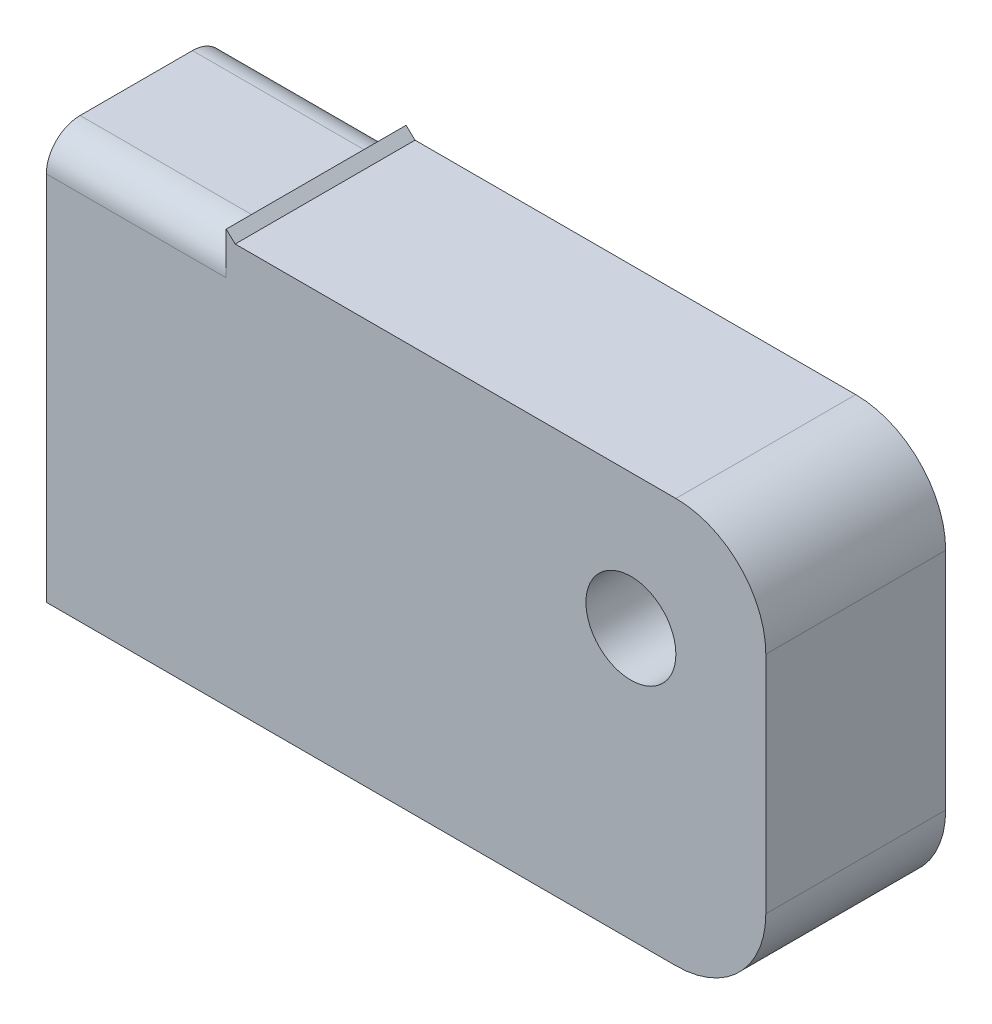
ISO-10303-21;
HEADER;
FILE_DESCRIPTION(('STEP AP214'),'2;1');
FILE_NAME('part.step','',(''),(''),'','','');
FILE_SCHEMA(('AUTOMOTIVE_DESIGN { 1 0 10303 214 1 1 1 1 }'));
ENDSEC;
DATA;
#1=APPLICATION_CONTEXT('core data for automotive mechanical design processes');
#2=APPLICATION_PROTOCOL_DEFINITION('international standard','automotive_design',2000,#1);
#3=PRODUCT_CONTEXT('',#1,'mechanical');
#4=PRODUCT('Part','Part','',(#3));
#5=PRODUCT_RELATED_PRODUCT_CATEGORY('part','',(#4));
#6=PRODUCT_DEFINITION_FORMATION('','',#4);
#7=PRODUCT_DEFINITION_CONTEXT('part definition',#1,'design');
#8=PRODUCT_DEFINITION('design','',#6,#7);
#9=PRODUCT_DEFINITION_SHAPE('','',#8);
#10=(LENGTH_UNIT() NAMED_UNIT(*) SI_UNIT(.MILLI.,.METRE.));
#11=(NAMED_UNIT(*) PLANE_ANGLE_UNIT() SI_UNIT($,.RADIAN.));
#12=(NAMED_UNIT(*) SI_UNIT($,.STERADIAN.) SOLID_ANGLE_UNIT());
#13=UNCERTAINTY_MEASURE_WITH_UNIT(LENGTH_MEASURE(1.E-05),#10,'distance_accuracy_value','');
#14=(GEOMETRIC_REPRESENTATION_CONTEXT(3) GLOBAL_UNCERTAINTY_ASSIGNED_CONTEXT((#13)) GLOBAL_UNIT_ASSIGNED_CONTEXT((#10,
#11,#12)) REPRESENTATION_CONTEXT('',''));
#15=CARTESIAN_POINT('',(0.,0.,0.));
#16=DIRECTION('',(0.,0.,1.));
#17=DIRECTION('',(1.,0.,0.));
#18=AXIS2_PLACEMENT_3D('',#15,#16,#17);
#19=CARTESIAN_POINT('',(0.,0.,50.8));
#20=DIRECTION('',(0.,-1.,0.));
#21=DIRECTION('',(1.,0.,0.));
#22=AXIS2_PLACEMENT_3D('',#19,#20,#21);
#23=PLANE('',#22);
#24=DIRECTION('',(0.,0.,-1.));
#25=VECTOR('',#24,1.);
#26=CARTESIAN_POINT('',(-203.2,0.,50.8));
#27=LINE('',#26,#25);
#28=CARTESIAN_POINT('',(-203.2,0.,41.275));
#29=VERTEX_POINT('',#28);
#30=CARTESIAN_POINT('',(-203.2,0.,9.525));
#31=VERTEX_POINT('',#30);
#32=EDGE_CURVE('E175',#29,#31,#27,.T.);
#33=ORIENTED_EDGE('',*,*,#32,.F.);
#34=DIRECTION('',(-1.,0.,0.));
#35=VECTOR('',#34,1.);
#36=CARTESIAN_POINT('',(0.,0.,41.275));
#37=LINE('',#36,#35);
#38=CARTESIAN_POINT('',(-152.4,0.,41.275));
#39=VERTEX_POINT('',#38);
#40=EDGE_CURVE('E55',#29,#39,#37,.F.);
#41=ORIENTED_EDGE('',*,*,#40,.T.);
#42=DIRECTION('',(0.,0.,1.));
#43=VECTOR('',#42,1.);
#44=CARTESIAN_POINT('',(-152.4,0.,0.));
#45=LINE('',#44,#43);
#46=CARTESIAN_POINT('',(-152.4,0.,9.525));
#47=VERTEX_POINT('',#46);
#48=EDGE_CURVE('E123',#47,#39,#45,.T.);
#49=ORIENTED_EDGE('',*,*,#48,.F.);
#50=DIRECTION('',(-1.,0.,0.));
#51=VECTOR('',#50,1.);
#52=CARTESIAN_POINT('',(-203.2,0.,9.525));
#53=LINE('',#52,#51);
#54=EDGE_CURVE('E203',#47,#31,#53,.T.);
#55=ORIENTED_EDGE('',*,*,#54,.T.);
#56=EDGE_LOOP('',(#33,#41,#49,#55));
#57=FACE_BOUND('',#56,.T.);
#58=ADVANCED_FACE('F33',(#57),#23,.F.);
#59=CARTESIAN_POINT('',(0.,-114.3,50.8));
#60=DIRECTION('',(-1.,0.,0.));
#61=DIRECTION('',(0.,0.,1.));
#62=AXIS2_PLACEMENT_3D('',#59,#60,#61);
#63=PLANE('',#62);
#64=DIRECTION('',(0.,1.,0.));
#65=VECTOR('',#64,1.);
#66=CARTESIAN_POINT('',(0.,-114.3,50.8));
#67=LINE('',#66,#65);
#68=CARTESIAN_POINT('',(0.,-88.9,50.8));
#69=VERTEX_POINT('',#68);
#70=CARTESIAN_POINT('',(0.,-25.4,50.8));
#71=VERTEX_POINT('',#70);
#72=EDGE_CURVE('E152',#69,#71,#67,.T.);
#73=ORIENTED_EDGE('',*,*,#72,.F.);
#74=DIRECTION('',(0.,0.,-1.));
#75=VECTOR('',#74,1.);
#76=CARTESIAN_POINT('',(0.,-88.9,50.8));
#77=LINE('',#76,#75);
#78=CARTESIAN_POINT('',(0.,-88.9,0.));
#79=VERTEX_POINT('',#78);
#80=EDGE_CURVE('E180',#69,#79,#77,.T.);
#81=ORIENTED_EDGE('',*,*,#80,.T.);
#82=DIRECTION('',(0.,1.,0.));
#83=VECTOR('',#82,1.);
#84=CARTESIAN_POINT('',(0.,-114.3,0.));
#85=LINE('',#84,#83);
#86=CARTESIAN_POINT('',(0.,-25.4,0.));
#87=VERTEX_POINT('',#86);
#88=EDGE_CURVE('E149',#79,#87,#85,.T.);
#89=ORIENTED_EDGE('',*,*,#88,.T.);
#90=DIRECTION('',(0.,0.,-1.));
#91=VECTOR('',#90,1.);
#92=CARTESIAN_POINT('',(0.,-25.4,50.8));
#93=LINE('',#92,#91);
#94=EDGE_CURVE('E178',#87,#71,#93,.F.);
#95=ORIENTED_EDGE('',*,*,#94,.T.);
#96=EDGE_LOOP('',(#73,#81,#89,#95));
#97=FACE_BOUND('',#96,.T.);
#98=ADVANCED_FACE('F229',(#97),#63,.F.);
#99=DIRECTION('',(-1.,0.,0.));
#100=VECTOR('',#99,1.);
#101=CARTESIAN_POINT('',(0.,0.,0.));
#102=LINE('',#101,#100);
#103=CARTESIAN_POINT('',(-25.4,0.,0.));
#104=VERTEX_POINT('',#103);
#105=CARTESIAN_POINT('',(-149.86,0.,0.));
#106=VERTEX_POINT('',#105);
#107=EDGE_CURVE('E167',#104,#106,#102,.T.);
#108=ORIENTED_EDGE('',*,*,#107,.T.);
#109=DIRECTION('',(0.,0.,1.));
#110=VECTOR('',#109,1.);
#111=CARTESIAN_POINT('',(-149.86,0.,0.));
#112=LINE('',#111,#110);
#113=CARTESIAN_POINT('',(-149.86,0.,50.8));
#114=VERTEX_POINT('',#113);
#115=EDGE_CURVE('E124',#106,#114,#112,.T.);
#116=ORIENTED_EDGE('',*,*,#115,.T.);
#117=DIRECTION('',(-1.,0.,0.));
#118=VECTOR('',#117,1.);
#119=CARTESIAN_POINT('',(0.,0.,50.8));
#120=LINE('',#119,#118);
#121=CARTESIAN_POINT('',(-25.4,0.,50.8));
#122=VERTEX_POINT('',#121);
#123=EDGE_CURVE('E155',#122,#114,#120,.T.);
#124=ORIENTED_EDGE('',*,*,#123,.F.);
#125=DIRECTION('',(0.,0.,-1.));
#126=VECTOR('',#125,1.);
#127=CARTESIAN_POINT('',(-25.4,0.,50.8));
#128=LINE('',#127,#126);
#129=EDGE_CURVE('E193',#122,#104,#128,.T.);
#130=ORIENTED_EDGE('',*,*,#129,.T.);
#131=EDGE_LOOP('',(#108,#116,#124,#130));
#132=FACE_BOUND('',#131,.T.);
#133=ADVANCED_FACE('F237',(#132),#23,.F.);
#134=CARTESIAN_POINT('',(-203.2,0.,50.8));
#135=DIRECTION('',(1.,0.,0.));
#136=DIRECTION('',(0.,1.,0.));
#137=AXIS2_PLACEMENT_3D('',#134,#135,#136);
#138=PLANE('',#137);
#139=DIRECTION('',(0.,-1.,0.));
#140=VECTOR('',#139,1.);
#141=CARTESIAN_POINT('',(-203.2,0.,50.8));
#142=LINE('',#141,#140);
#143=CARTESIAN_POINT('',(-203.2,-9.52500000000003,50.8));
#144=VERTEX_POINT('',#143);
#145=CARTESIAN_POINT('',(-203.2,-114.3,50.8));
#146=VERTEX_POINT('',#145);
#147=EDGE_CURVE('E159',#144,#146,#142,.T.);
#148=ORIENTED_EDGE('',*,*,#147,.F.);
#149=CARTESIAN_POINT('',(-203.2,-9.52500000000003,41.275));
#150=DIRECTION('',(1.,0.,0.));
#151=DIRECTION('',(0.,1.,0.));
#152=AXIS2_PLACEMENT_3D('',#149,#150,#151);
#153=CIRCLE('',#152,9.525);
#154=EDGE_CURVE('E201',#144,#29,#153,.F.);
#155=ORIENTED_EDGE('',*,*,#154,.T.);
#156=ORIENTED_EDGE('',*,*,#32,.T.);
#157=CARTESIAN_POINT('',(-203.2,-9.52500000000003,9.525));
#158=DIRECTION('',(1.,0.,0.));
#159=DIRECTION('',(0.,1.,0.));
#160=AXIS2_PLACEMENT_3D('',#157,#158,#159);
#161=CIRCLE('',#160,9.525);
#162=CARTESIAN_POINT('',(-203.2,-9.52500000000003,0.));
#163=VERTEX_POINT('',#162);
#164=EDGE_CURVE('E199',#31,#163,#161,.F.);
#165=ORIENTED_EDGE('',*,*,#164,.T.);
#166=DIRECTION('',(0.,-1.,0.));
#167=VECTOR('',#166,1.);
#168=CARTESIAN_POINT('',(-203.2,0.,0.));
#169=LINE('',#168,#167);
#170=CARTESIAN_POINT('',(-203.2,-114.3,0.));
#171=VERTEX_POINT('',#170);
#172=EDGE_CURVE('E169',#163,#171,#169,.T.);
#173=ORIENTED_EDGE('',*,*,#172,.T.);
#174=DIRECTION('',(0.,0.,-1.));
#175=VECTOR('',#174,1.);
#176=CARTESIAN_POINT('',(-203.2,-114.3,50.8));
#177=LINE('',#176,#175);
#178=EDGE_CURVE('E164',#146,#171,#177,.T.);
#179=ORIENTED_EDGE('',*,*,#178,.F.);
#180=EDGE_LOOP('',(#148,#155,#156,#165,#173,#179));
#181=FACE_BOUND('',#180,.T.);
#182=ADVANCED_FACE('F216',(#181),#138,.F.);
#183=CARTESIAN_POINT('',(-203.2,-114.3,50.8));
#184=DIRECTION('',(0.,1.,0.));
#185=DIRECTION('',(0.,0.,1.));
#186=AXIS2_PLACEMENT_3D('',#183,#184,#185);
#187=PLANE('',#186);
#188=DIRECTION('',(1.,0.,0.));
#189=VECTOR('',#188,1.);
#190=CARTESIAN_POINT('',(-203.2,-114.3,0.));
#191=LINE('',#190,#189);
#192=CARTESIAN_POINT('',(-25.4,-114.3,0.));
#193=VERTEX_POINT('',#192);
#194=EDGE_CURVE('E156',#171,#193,#191,.T.);
#195=ORIENTED_EDGE('',*,*,#194,.T.);
#196=DIRECTION('',(0.,0.,-1.));
#197=VECTOR('',#196,1.);
#198=CARTESIAN_POINT('',(-25.4,-114.3,50.8));
#199=LINE('',#198,#197);
#200=CARTESIAN_POINT('',(-25.4,-114.3,50.8));
#201=VERTEX_POINT('',#200);
#202=EDGE_CURVE('E187',#193,#201,#199,.F.);
#203=ORIENTED_EDGE('',*,*,#202,.T.);
#204=DIRECTION('',(1.,0.,0.));
#205=VECTOR('',#204,1.);
#206=CARTESIAN_POINT('',(-203.2,-114.3,50.8));
#207=LINE('',#206,#205);
#208=EDGE_CURVE('E161',#146,#201,#207,.T.);
#209=ORIENTED_EDGE('',*,*,#208,.F.);
#210=ORIENTED_EDGE('',*,*,#178,.T.);
#211=EDGE_LOOP('',(#195,#203,#209,#210));
#212=FACE_BOUND('',#211,.T.);
#213=ADVANCED_FACE('F220',(#212),#187,.F.);
#214=CARTESIAN_POINT('',(0.,-114.3,50.8));
#215=DIRECTION('',(0.,0.,-1.));
#216=DIRECTION('',(-1.,0.,0.));
#217=AXIS2_PLACEMENT_3D('',#214,#215,#216);
#218=PLANE('',#217);
#219=CARTESIAN_POINT('',(-38.1,-38.1,50.8));
#220=DIRECTION('',(0.,0.,1.));
#221=DIRECTION('',(1.,0.,0.));
#222=AXIS2_PLACEMENT_3D('',#219,#220,#221);
#223=CIRCLE('',#222,12.7);
#224=CARTESIAN_POINT('',(-25.4,-38.1,50.8));
#225=VERTEX_POINT('',#224);
#226=EDGE_CURVE('E144',#225,#225,#223,.T.);
#227=ORIENTED_EDGE('',*,*,#226,.F.);
#228=EDGE_LOOP('',(#227));
#229=FACE_BOUND('',#228,.T.);
#230=DIRECTION('',(0.,-1.,0.));
#231=VECTOR('',#230,1.);
#232=CARTESIAN_POINT('',(-152.4,0.,50.8));
#233=LINE('',#232,#231);
#234=CARTESIAN_POINT('',(-152.4,2.37078081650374,50.8));
#235=VERTEX_POINT('',#234);
#236=CARTESIAN_POINT('',(-152.4,-9.52500000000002,50.8));
#237=VERTEX_POINT('',#236);
#238=EDGE_CURVE('E119',#235,#237,#233,.T.);
#239=ORIENTED_EDGE('',*,*,#238,.T.);
#240=DIRECTION('',(-1.,0.,0.));
#241=VECTOR('',#240,1.);
#242=CARTESIAN_POINT('',(0.,-9.52500000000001,50.8));
#243=LINE('',#242,#241);
#244=EDGE_CURVE('E196',#237,#144,#243,.T.);
#245=ORIENTED_EDGE('',*,*,#244,.T.);
#246=ORIENTED_EDGE('',*,*,#147,.T.);
#247=ORIENTED_EDGE('',*,*,#208,.T.);
#248=CARTESIAN_POINT('',(-25.4,-88.9,50.8));
#249=DIRECTION('',(0.,0.,-1.));
#250=DIRECTION('',(-1.,0.,0.));
#251=AXIS2_PLACEMENT_3D('',#248,#249,#250);
#252=CIRCLE('',#251,25.4);
#253=EDGE_CURVE('E191',#201,#69,#252,.F.);
#254=ORIENTED_EDGE('',*,*,#253,.T.);
#255=ORIENTED_EDGE('',*,*,#72,.T.);
#256=CARTESIAN_POINT('',(-25.4,-25.4,50.8));
#257=DIRECTION('',(0.,0.,-1.));
#258=DIRECTION('',(-1.,0.,0.));
#259=AXIS2_PLACEMENT_3D('',#256,#257,#258);
#260=CIRCLE('',#259,25.4);
#261=EDGE_CURVE('E189',#71,#122,#260,.F.);
#262=ORIENTED_EDGE('',*,*,#261,.T.);
#263=ORIENTED_EDGE('',*,*,#123,.T.);
#264=DIRECTION('',(-0.731038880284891,0.682335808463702,0.));
#265=VECTOR('',#264,1.);
#266=CARTESIAN_POINT('',(-152.4,2.37078081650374,50.8));
#267=LINE('',#266,#265);
#268=EDGE_CURVE('E141',#114,#235,#267,.T.);
#269=ORIENTED_EDGE('',*,*,#268,.T.);
#270=EDGE_LOOP('',(#239,#245,#246,#247,#254,#255,#262,#263,#269));
#271=FACE_BOUND('',#270,.T.);
#272=ADVANCED_FACE('F213',(#229,#271),#218,.F.);
#273=CARTESIAN_POINT('',(0.,-114.3,0.));
#274=DIRECTION('',(0.,0.,-1.));
#275=DIRECTION('',(-1.,0.,0.));
#276=AXIS2_PLACEMENT_3D('',#273,#274,#275);
#277=PLANE('',#276);
#278=CARTESIAN_POINT('',(-38.1,-38.1,0.));
#279=DIRECTION('',(0.,0.,1.));
#280=DIRECTION('',(1.,0.,0.));
#281=AXIS2_PLACEMENT_3D('',#278,#279,#280);
#282=CIRCLE('',#281,12.7);
#283=CARTESIAN_POINT('',(-25.4,-38.1,0.));
#284=VERTEX_POINT('',#283);
#285=EDGE_CURVE('E146',#284,#284,#282,.T.);
#286=ORIENTED_EDGE('',*,*,#285,.T.);
#287=EDGE_LOOP('',(#286));
#288=FACE_BOUND('',#287,.T.);
#289=ORIENTED_EDGE('',*,*,#172,.F.);
#290=DIRECTION('',(-1.,0.,0.));
#291=VECTOR('',#290,1.);
#292=CARTESIAN_POINT('',(-152.4,-9.52500000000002,0.));
#293=LINE('',#292,#291);
#294=CARTESIAN_POINT('',(-152.4,-9.52500000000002,0.));
#295=VERTEX_POINT('',#294);
#296=EDGE_CURVE('E136',#163,#295,#293,.F.);
#297=ORIENTED_EDGE('',*,*,#296,.T.);
#298=DIRECTION('',(0.,-1.,0.));
#299=VECTOR('',#298,1.);
#300=CARTESIAN_POINT('',(-152.4,0.,0.));
#301=LINE('',#300,#299);
#302=CARTESIAN_POINT('',(-152.4,2.37078081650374,0.));
#303=VERTEX_POINT('',#302);
#304=EDGE_CURVE('E47',#303,#295,#301,.T.);
#305=ORIENTED_EDGE('',*,*,#304,.F.);
#306=DIRECTION('',(-0.731038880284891,0.682335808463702,0.));
#307=VECTOR('',#306,1.);
#308=CARTESIAN_POINT('',(-152.4,2.37078081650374,0.));
#309=LINE('',#308,#307);
#310=EDGE_CURVE('E128',#106,#303,#309,.T.);
#311=ORIENTED_EDGE('',*,*,#310,.F.);
#312=ORIENTED_EDGE('',*,*,#107,.F.);
#313=CARTESIAN_POINT('',(-25.4,-25.4,0.));
#314=DIRECTION('',(0.,0.,-1.));
#315=DIRECTION('',(-1.,0.,0.));
#316=AXIS2_PLACEMENT_3D('',#313,#314,#315);
#317=CIRCLE('',#316,25.4);
#318=EDGE_CURVE('E183',#104,#87,#317,.T.);
#319=ORIENTED_EDGE('',*,*,#318,.T.);
#320=ORIENTED_EDGE('',*,*,#88,.F.);
#321=CARTESIAN_POINT('',(-25.4,-88.9,0.));
#322=DIRECTION('',(0.,0.,-1.));
#323=DIRECTION('',(-1.,0.,0.));
#324=AXIS2_PLACEMENT_3D('',#321,#322,#323);
#325=CIRCLE('',#324,25.4);
#326=EDGE_CURVE('E185',#79,#193,#325,.T.);
#327=ORIENTED_EDGE('',*,*,#326,.T.);
#328=ORIENTED_EDGE('',*,*,#194,.F.);
#329=EDGE_LOOP('',(#289,#297,#305,#311,#312,#319,#320,#327,#328));
#330=FACE_BOUND('',#329,.T.);
#331=ADVANCED_FACE('F134',(#288,#330),#277,.T.);
#332=CARTESIAN_POINT('',(-38.1,-38.1,0.));
#333=DIRECTION('',(0.,0.,1.));
#334=DIRECTION('',(1.,0.,0.));
#335=AXIS2_PLACEMENT_3D('',#332,#333,#334);
#336=CYLINDRICAL_SURFACE('',#335,12.7);
#337=ORIENTED_EDGE('',*,*,#285,.F.);
#338=EDGE_LOOP('',(#337));
#339=FACE_BOUND('',#338,.T.);
#340=ORIENTED_EDGE('',*,*,#226,.T.);
#341=EDGE_LOOP('',(#340));
#342=FACE_BOUND('',#341,.T.);
#343=ADVANCED_FACE('F263',(#339,#342),#336,.F.);
#344=CARTESIAN_POINT('',(-25.4,-88.9,50.8));
#345=DIRECTION('',(0.,0.,-1.));
#346=DIRECTION('',(-1.,0.,0.));
#347=AXIS2_PLACEMENT_3D('',#344,#345,#346);
#348=CYLINDRICAL_SURFACE('',#347,25.4);
#349=ORIENTED_EDGE('',*,*,#253,.F.);
#350=ORIENTED_EDGE('',*,*,#202,.F.);
#351=ORIENTED_EDGE('',*,*,#326,.F.);
#352=ORIENTED_EDGE('',*,*,#80,.F.);
#353=EDGE_LOOP('',(#349,#350,#351,#352));
#354=FACE_BOUND('',#353,.T.);
#355=ADVANCED_FACE('F226',(#354),#348,.T.);
#356=CARTESIAN_POINT('',(-25.4,-25.4,50.8));
#357=DIRECTION('',(0.,0.,-1.));
#358=DIRECTION('',(-1.,0.,0.));
#359=AXIS2_PLACEMENT_3D('',#356,#357,#358);
#360=CYLINDRICAL_SURFACE('',#359,25.4);
#361=ORIENTED_EDGE('',*,*,#261,.F.);
#362=ORIENTED_EDGE('',*,*,#94,.F.);
#363=ORIENTED_EDGE('',*,*,#318,.F.);
#364=ORIENTED_EDGE('',*,*,#129,.F.);
#365=EDGE_LOOP('',(#361,#362,#363,#364));
#366=FACE_BOUND('',#365,.T.);
#367=ADVANCED_FACE('F234',(#366),#360,.T.);
#368=CARTESIAN_POINT('',(-152.4,0.,0.));
#369=DIRECTION('',(-1.,0.,0.));
#370=DIRECTION('',(0.,0.,1.));
#371=AXIS2_PLACEMENT_3D('',#368,#369,#370);
#372=PLANE('',#371);
#373=ORIENTED_EDGE('',*,*,#238,.F.);
#374=DIRECTION('',(0.,0.,1.));
#375=VECTOR('',#374,1.);
#376=CARTESIAN_POINT('',(-152.4,2.37078081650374,0.));
#377=LINE('',#376,#375);
#378=EDGE_CURVE('E115',#303,#235,#377,.T.);
#379=ORIENTED_EDGE('',*,*,#378,.F.);
#380=ORIENTED_EDGE('',*,*,#304,.T.);
#381=CARTESIAN_POINT('',(-152.4,-9.52500000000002,9.525));
#382=DIRECTION('',(-1.,0.,0.));
#383=DIRECTION('',(0.,0.,1.));
#384=AXIS2_PLACEMENT_3D('',#381,#382,#383);
#385=CIRCLE('',#384,9.525);
#386=EDGE_CURVE('E11',#295,#47,#385,.F.);
#387=ORIENTED_EDGE('',*,*,#386,.T.);
#388=ORIENTED_EDGE('',*,*,#48,.T.);
#389=CARTESIAN_POINT('',(-152.4,-9.52500000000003,41.275));
#390=DIRECTION('',(-1.,0.,0.));
#391=DIRECTION('',(0.,0.,1.));
#392=AXIS2_PLACEMENT_3D('',#389,#390,#391);
#393=CIRCLE('',#392,9.525);
#394=EDGE_CURVE('E41',#39,#237,#393,.F.);
#395=ORIENTED_EDGE('',*,*,#394,.T.);
#396=EDGE_LOOP('',(#373,#379,#380,#387,#388,#395));
#397=FACE_BOUND('',#396,.T.);
#398=ADVANCED_FACE('F117',(#397),#372,.T.);
#399=CARTESIAN_POINT('',(-152.4,2.37078081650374,0.));
#400=DIRECTION('',(0.682335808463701,0.731038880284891,0.));
#401=DIRECTION('',(-0.731038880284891,0.682335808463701,0.));
#402=AXIS2_PLACEMENT_3D('',#399,#400,#401);
#403=PLANE('',#402);
#404=ORIENTED_EDGE('',*,*,#268,.F.);
#405=ORIENTED_EDGE('',*,*,#115,.F.);
#406=ORIENTED_EDGE('',*,*,#310,.T.);
#407=ORIENTED_EDGE('',*,*,#378,.T.);
#408=EDGE_LOOP('',(#404,#405,#406,#407));
#409=FACE_BOUND('',#408,.T.);
#410=ADVANCED_FACE('F129',(#409),#403,.T.);
#411=CARTESIAN_POINT('',(0.,-9.52500000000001,41.275));
#412=DIRECTION('',(-1.,0.,0.));
#413=DIRECTION('',(0.,-1.,0.));
#414=AXIS2_PLACEMENT_3D('',#411,#412,#413);
#415=CYLINDRICAL_SURFACE('',#414,9.525);
#416=ORIENTED_EDGE('',*,*,#394,.F.);
#417=ORIENTED_EDGE('',*,*,#40,.F.);
#418=ORIENTED_EDGE('',*,*,#154,.F.);
#419=ORIENTED_EDGE('',*,*,#244,.F.);
#420=EDGE_LOOP('',(#416,#417,#418,#419));
#421=FACE_BOUND('',#420,.T.);
#422=ADVANCED_FACE('F210',(#421),#415,.T.);
#423=CARTESIAN_POINT('',(0.,-9.525,9.525));
#424=DIRECTION('',(1.,0.,0.));
#425=DIRECTION('',(0.,1.,0.));
#426=AXIS2_PLACEMENT_3D('',#423,#424,#425);
#427=CYLINDRICAL_SURFACE('',#426,9.525);
#428=ORIENTED_EDGE('',*,*,#386,.F.);
#429=ORIENTED_EDGE('',*,*,#296,.F.);
#430=ORIENTED_EDGE('',*,*,#164,.F.);
#431=ORIENTED_EDGE('',*,*,#54,.F.);
#432=EDGE_LOOP('',(#428,#429,#430,#431));
#433=FACE_BOUND('',#432,.T.);
#434=ADVANCED_FACE('F35',(#433),#427,.T.);
#435=CLOSED_SHELL('',(#58,#98,#133,#182,#213,#272,#331,#343,#355,#367,#398,#410,#422,#434));
#436=MANIFOLD_SOLID_BREP('B2',#435);
#437=ADVANCED_BREP_SHAPE_REPRESENTATION('',(#18,#436),#14);
#438=SHAPE_DEFINITION_REPRESENTATION(#9,#437);
ENDSEC;
END-ISO-10303-21;
